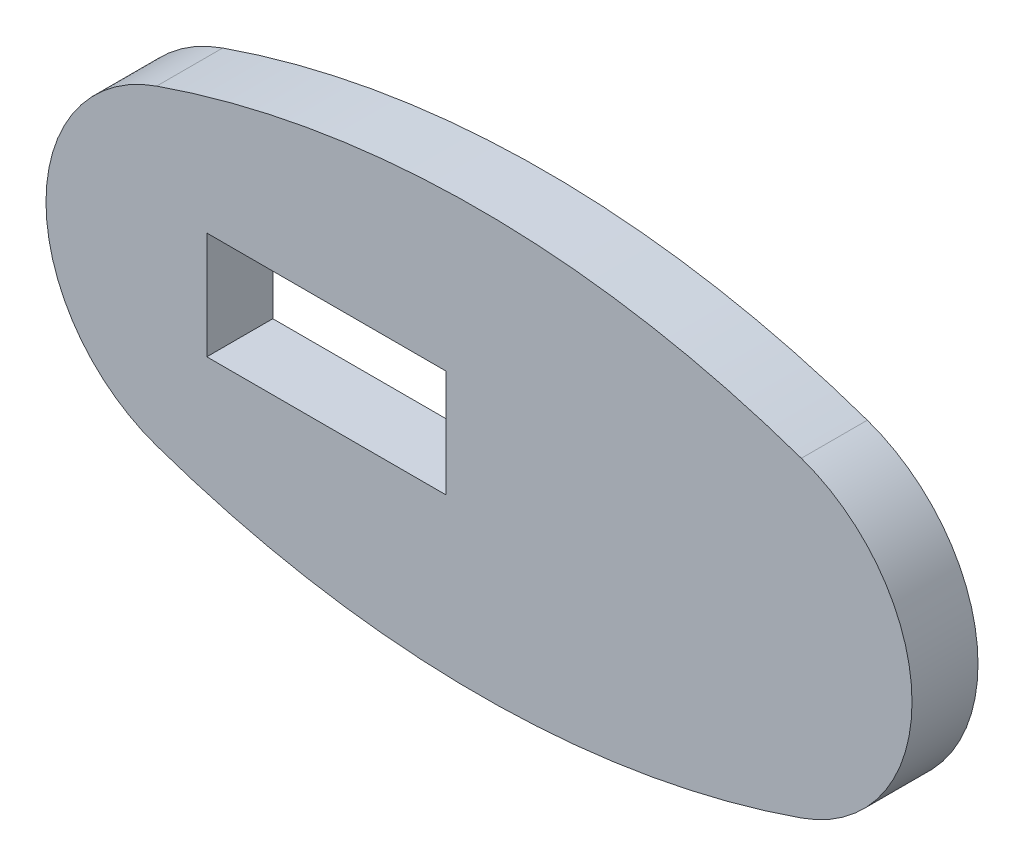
ISO-10303-21;
HEADER;
FILE_DESCRIPTION(('STEP AP214'),'2;1');
FILE_NAME('part.step','',(''),(''),'','','');
FILE_SCHEMA(('AUTOMOTIVE_DESIGN { 1 0 10303 214 1 1 1 1 }'));
ENDSEC;
DATA;
#1=APPLICATION_CONTEXT('core data for automotive mechanical design processes');
#2=APPLICATION_PROTOCOL_DEFINITION('international standard','automotive_design',2000,#1);
#3=PRODUCT_CONTEXT('',#1,'mechanical');
#4=PRODUCT('Part','Part','',(#3));
#5=PRODUCT_RELATED_PRODUCT_CATEGORY('part','',(#4));
#6=PRODUCT_DEFINITION_FORMATION('','',#4);
#7=PRODUCT_DEFINITION_CONTEXT('part definition',#1,'design');
#8=PRODUCT_DEFINITION('design','',#6,#7);
#9=PRODUCT_DEFINITION_SHAPE('','',#8);
#10=(LENGTH_UNIT() NAMED_UNIT(*) SI_UNIT(.MILLI.,.METRE.));
#11=(NAMED_UNIT(*) PLANE_ANGLE_UNIT() SI_UNIT($,.RADIAN.));
#12=(NAMED_UNIT(*) SI_UNIT($,.STERADIAN.) SOLID_ANGLE_UNIT());
#13=UNCERTAINTY_MEASURE_WITH_UNIT(LENGTH_MEASURE(1.E-05),#10,'distance_accuracy_value','');
#14=(GEOMETRIC_REPRESENTATION_CONTEXT(3) GLOBAL_UNCERTAINTY_ASSIGNED_CONTEXT((#13)) GLOBAL_UNIT_ASSIGNED_CONTEXT((#10,
#11,#12)) REPRESENTATION_CONTEXT('',''));
#15=CARTESIAN_POINT('',(0.,0.,0.));
#16=DIRECTION('',(0.,0.,1.));
#17=DIRECTION('',(1.,0.,0.));
#18=AXIS2_PLACEMENT_3D('',#15,#16,#17);
#19=CARTESIAN_POINT('',(16.25,0.,4.));
#20=DIRECTION('',(0.,0.,-1.));
#21=DIRECTION('',(-1.,0.,0.));
#22=AXIS2_PLACEMENT_3D('',#19,#20,#21);
#23=CYLINDRICAL_SURFACE('',#22,9.99999999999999);
#24=CARTESIAN_POINT('',(16.25,0.,0.));
#25=DIRECTION('',(0.,0.,1.));
#26=DIRECTION('',(1.,0.,0.));
#27=AXIS2_PLACEMENT_3D('',#24,#25,#26);
#28=CIRCLE('',#27,9.99999999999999);
#29=CARTESIAN_POINT('',(19.5403819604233,-9.44316612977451,0.));
#30=VERTEX_POINT('',#29);
#31=CARTESIAN_POINT('',(19.5403819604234,9.44316612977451,0.));
#32=VERTEX_POINT('',#31);
#33=EDGE_CURVE('E132',#30,#32,#28,.T.);
#34=ORIENTED_EDGE('',*,*,#33,.T.);
#35=DIRECTION('',(0.,0.,-1.));
#36=VECTOR('',#35,1.);
#37=CARTESIAN_POINT('',(19.5403819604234,9.44316612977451,4.));
#38=LINE('',#37,#36);
#39=CARTESIAN_POINT('',(19.5403819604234,9.44316612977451,4.));
#40=VERTEX_POINT('',#39);
#41=EDGE_CURVE('E13',#40,#32,#38,.T.);
#42=ORIENTED_EDGE('',*,*,#41,.F.);
#43=CARTESIAN_POINT('',(16.25,0.,4.));
#44=DIRECTION('',(0.,0.,1.));
#45=DIRECTION('',(1.,0.,0.));
#46=AXIS2_PLACEMENT_3D('',#43,#44,#45);
#47=CIRCLE('',#46,9.99999999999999);
#48=CARTESIAN_POINT('',(19.5403819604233,-9.44316612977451,4.));
#49=VERTEX_POINT('',#48);
#50=EDGE_CURVE('E143',#49,#40,#47,.T.);
#51=ORIENTED_EDGE('',*,*,#50,.F.);
#52=DIRECTION('',(0.,0.,-1.));
#53=VECTOR('',#52,1.);
#54=CARTESIAN_POINT('',(19.5403819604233,-9.44316612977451,4.));
#55=LINE('',#54,#53);
#56=EDGE_CURVE('E152',#49,#30,#55,.T.);
#57=ORIENTED_EDGE('',*,*,#56,.T.);
#58=EDGE_LOOP('',(#34,#42,#51,#57));
#59=FACE_BOUND('',#58,.T.);
#60=ADVANCED_FACE('F34',(#59),#23,.T.);
#61=CARTESIAN_POINT('',(0.,-46.6363636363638,4.));
#62=DIRECTION('',(0.,0.,-1.));
#63=DIRECTION('',(-1.,0.,0.));
#64=AXIS2_PLACEMENT_3D('',#61,#62,#63);
#65=CYLINDRICAL_SURFACE('',#64,59.3863636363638);
#66=CARTESIAN_POINT('',(0.,-46.6363636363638,0.));
#67=DIRECTION('',(0.,0.,1.));
#68=DIRECTION('',(-1.,0.,0.));
#69=AXIS2_PLACEMENT_3D('',#66,#67,#68);
#70=CIRCLE('',#69,59.3863636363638);
#71=CARTESIAN_POINT('',(-19.5403819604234,9.44316612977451,0.));
#72=VERTEX_POINT('',#71);
#73=EDGE_CURVE('E137',#32,#72,#70,.T.);
#74=ORIENTED_EDGE('',*,*,#73,.T.);
#75=DIRECTION('',(0.,0.,-1.));
#76=VECTOR('',#75,1.);
#77=CARTESIAN_POINT('',(-19.5403819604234,9.44316612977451,4.));
#78=LINE('',#77,#76);
#79=CARTESIAN_POINT('',(-19.5403819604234,9.44316612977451,4.));
#80=VERTEX_POINT('',#79);
#81=EDGE_CURVE('E41',#80,#72,#78,.T.);
#82=ORIENTED_EDGE('',*,*,#81,.F.);
#83=CARTESIAN_POINT('',(0.,-46.6363636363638,4.));
#84=DIRECTION('',(0.,0.,1.));
#85=DIRECTION('',(-1.,0.,0.));
#86=AXIS2_PLACEMENT_3D('',#83,#84,#85);
#87=CIRCLE('',#86,59.3863636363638);
#88=EDGE_CURVE('E146',#40,#80,#87,.T.);
#89=ORIENTED_EDGE('',*,*,#88,.F.);
#90=ORIENTED_EDGE('',*,*,#41,.T.);
#91=EDGE_LOOP('',(#74,#82,#89,#90));
#92=FACE_BOUND('',#91,.T.);
#93=ADVANCED_FACE('F176',(#92),#65,.T.);
#94=CARTESIAN_POINT('',(-16.25,0.,4.));
#95=DIRECTION('',(0.,0.,-1.));
#96=DIRECTION('',(-1.,0.,0.));
#97=AXIS2_PLACEMENT_3D('',#94,#95,#96);
#98=CYLINDRICAL_SURFACE('',#97,10.);
#99=CARTESIAN_POINT('',(-16.25,0.,0.));
#100=DIRECTION('',(0.,0.,1.));
#101=DIRECTION('',(-1.,0.,0.));
#102=AXIS2_PLACEMENT_3D('',#99,#100,#101);
#103=CIRCLE('',#102,10.);
#104=CARTESIAN_POINT('',(-19.5403819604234,-9.44316612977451,0.));
#105=VERTEX_POINT('',#104);
#106=EDGE_CURVE('E139',#72,#105,#103,.T.);
#107=ORIENTED_EDGE('',*,*,#106,.T.);
#108=DIRECTION('',(0.,0.,-1.));
#109=VECTOR('',#108,1.);
#110=CARTESIAN_POINT('',(-19.5403819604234,-9.44316612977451,4.));
#111=LINE('',#110,#109);
#112=CARTESIAN_POINT('',(-19.5403819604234,-9.44316612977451,4.));
#113=VERTEX_POINT('',#112);
#114=EDGE_CURVE('E155',#113,#105,#111,.T.);
#115=ORIENTED_EDGE('',*,*,#114,.F.);
#116=CARTESIAN_POINT('',(-16.25,0.,4.));
#117=DIRECTION('',(0.,0.,1.));
#118=DIRECTION('',(-1.,0.,0.));
#119=AXIS2_PLACEMENT_3D('',#116,#117,#118);
#120=CIRCLE('',#119,10.);
#121=EDGE_CURVE('E148',#80,#113,#120,.T.);
#122=ORIENTED_EDGE('',*,*,#121,.F.);
#123=ORIENTED_EDGE('',*,*,#81,.T.);
#124=EDGE_LOOP('',(#107,#115,#122,#123));
#125=FACE_BOUND('',#124,.T.);
#126=ADVANCED_FACE('F162',(#125),#98,.T.);
#127=CARTESIAN_POINT('',(0.,46.6363636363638,4.));
#128=DIRECTION('',(0.,0.,-1.));
#129=DIRECTION('',(-1.,0.,0.));
#130=AXIS2_PLACEMENT_3D('',#127,#128,#129);
#131=CYLINDRICAL_SURFACE('',#130,59.3863636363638);
#132=CARTESIAN_POINT('',(0.,46.6363636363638,0.));
#133=DIRECTION('',(0.,0.,1.));
#134=DIRECTION('',(1.,0.,0.));
#135=AXIS2_PLACEMENT_3D('',#132,#133,#134);
#136=CIRCLE('',#135,59.3863636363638);
#137=EDGE_CURVE('E141',#105,#30,#136,.T.);
#138=ORIENTED_EDGE('',*,*,#137,.T.);
#139=ORIENTED_EDGE('',*,*,#56,.F.);
#140=CARTESIAN_POINT('',(0.,46.6363636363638,4.));
#141=DIRECTION('',(0.,0.,1.));
#142=DIRECTION('',(1.,0.,0.));
#143=AXIS2_PLACEMENT_3D('',#140,#141,#142);
#144=CIRCLE('',#143,59.3863636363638);
#145=EDGE_CURVE('E150',#113,#49,#144,.T.);
#146=ORIENTED_EDGE('',*,*,#145,.F.);
#147=ORIENTED_EDGE('',*,*,#114,.T.);
#148=EDGE_LOOP('',(#138,#139,#146,#147));
#149=FACE_BOUND('',#148,.T.);
#150=ADVANCED_FACE('F171',(#149),#131,.T.);
#151=CARTESIAN_POINT('',(8.12500000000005,-23.3181818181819,4.));
#152=DIRECTION('',(0.,0.,1.));
#153=DIRECTION('',(1.,0.,0.));
#154=AXIS2_PLACEMENT_3D('',#151,#152,#153);
#155=PLANE('',#154);
#156=DIRECTION('',(0.,-1.,0.));
#157=VECTOR('',#156,1.);
#158=CARTESIAN_POINT('',(-16.5,3.25,4.));
#159=LINE('',#158,#157);
#160=CARTESIAN_POINT('',(-16.5,3.25,4.));
#161=VERTEX_POINT('',#160);
#162=CARTESIAN_POINT('',(-16.5,-3.25,4.));
#163=VERTEX_POINT('',#162);
#164=EDGE_CURVE('E48',#161,#163,#159,.T.);
#165=ORIENTED_EDGE('',*,*,#164,.F.);
#166=DIRECTION('',(-1.,0.,0.));
#167=VECTOR('',#166,1.);
#168=CARTESIAN_POINT('',(-16.5,3.25,4.));
#169=LINE('',#168,#167);
#170=CARTESIAN_POINT('',(-2.,3.25,4.));
#171=VERTEX_POINT('',#170);
#172=EDGE_CURVE('E116',#171,#161,#169,.T.);
#173=ORIENTED_EDGE('',*,*,#172,.F.);
#174=DIRECTION('',(0.,1.,0.));
#175=VECTOR('',#174,1.);
#176=CARTESIAN_POINT('',(-2.,3.25,4.));
#177=LINE('',#176,#175);
#178=CARTESIAN_POINT('',(-2.,-3.25,4.));
#179=VERTEX_POINT('',#178);
#180=EDGE_CURVE('E100',#179,#171,#177,.T.);
#181=ORIENTED_EDGE('',*,*,#180,.F.);
#182=DIRECTION('',(1.,0.,0.));
#183=VECTOR('',#182,1.);
#184=CARTESIAN_POINT('',(-16.5,-3.25,4.));
#185=LINE('',#184,#183);
#186=EDGE_CURVE('E109',#163,#179,#185,.T.);
#187=ORIENTED_EDGE('',*,*,#186,.F.);
#188=EDGE_LOOP('',(#165,#173,#181,#187));
#189=FACE_BOUND('',#188,.T.);
#190=ORIENTED_EDGE('',*,*,#50,.T.);
#191=ORIENTED_EDGE('',*,*,#88,.T.);
#192=ORIENTED_EDGE('',*,*,#121,.T.);
#193=ORIENTED_EDGE('',*,*,#145,.T.);
#194=EDGE_LOOP('',(#190,#191,#192,#193));
#195=FACE_BOUND('',#194,.T.);
#196=ADVANCED_FACE('F113',(#189,#195),#155,.T.);
#197=CARTESIAN_POINT('',(8.12500000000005,-23.3181818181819,0.));
#198=DIRECTION('',(0.,0.,1.));
#199=DIRECTION('',(1.,0.,0.));
#200=AXIS2_PLACEMENT_3D('',#197,#198,#199);
#201=PLANE('',#200);
#202=DIRECTION('',(-1.,0.,0.));
#203=VECTOR('',#202,1.);
#204=CARTESIAN_POINT('',(-16.5,3.25,0.));
#205=LINE('',#204,#203);
#206=CARTESIAN_POINT('',(-2.,3.25,0.));
#207=VERTEX_POINT('',#206);
#208=CARTESIAN_POINT('',(-16.5,3.25,0.));
#209=VERTEX_POINT('',#208);
#210=EDGE_CURVE('E127',#207,#209,#205,.T.);
#211=ORIENTED_EDGE('',*,*,#210,.T.);
#212=DIRECTION('',(0.,-1.,0.));
#213=VECTOR('',#212,1.);
#214=CARTESIAN_POINT('',(-16.5,3.25,0.));
#215=LINE('',#214,#213);
#216=CARTESIAN_POINT('',(-16.5,-3.25,0.));
#217=VERTEX_POINT('',#216);
#218=EDGE_CURVE('E118',#209,#217,#215,.T.);
#219=ORIENTED_EDGE('',*,*,#218,.T.);
#220=DIRECTION('',(1.,0.,0.));
#221=VECTOR('',#220,1.);
#222=CARTESIAN_POINT('',(-16.5,-3.25,0.));
#223=LINE('',#222,#221);
#224=CARTESIAN_POINT('',(-2.,-3.25,0.));
#225=VERTEX_POINT('',#224);
#226=EDGE_CURVE('E124',#217,#225,#223,.T.);
#227=ORIENTED_EDGE('',*,*,#226,.T.);
#228=DIRECTION('',(0.,1.,0.));
#229=VECTOR('',#228,1.);
#230=CARTESIAN_POINT('',(-2.,3.25,0.));
#231=LINE('',#230,#229);
#232=EDGE_CURVE('E56',#225,#207,#231,.T.);
#233=ORIENTED_EDGE('',*,*,#232,.T.);
#234=EDGE_LOOP('',(#211,#219,#227,#233));
#235=FACE_BOUND('',#234,.T.);
#236=ORIENTED_EDGE('',*,*,#33,.F.);
#237=ORIENTED_EDGE('',*,*,#137,.F.);
#238=ORIENTED_EDGE('',*,*,#106,.F.);
#239=ORIENTED_EDGE('',*,*,#73,.F.);
#240=EDGE_LOOP('',(#236,#237,#238,#239));
#241=FACE_BOUND('',#240,.T.);
#242=ADVANCED_FACE('F168',(#235,#241),#201,.F.);
#243=CARTESIAN_POINT('',(-16.5,3.25,0.));
#244=DIRECTION('',(-1.,0.,0.));
#245=DIRECTION('',(0.,0.,1.));
#246=AXIS2_PLACEMENT_3D('',#243,#244,#245);
#247=PLANE('',#246);
#248=ORIENTED_EDGE('',*,*,#164,.T.);
#249=DIRECTION('',(0.,0.,1.));
#250=VECTOR('',#249,1.);
#251=CARTESIAN_POINT('',(-16.5,-3.25,0.));
#252=LINE('',#251,#250);
#253=EDGE_CURVE('E106',#217,#163,#252,.T.);
#254=ORIENTED_EDGE('',*,*,#253,.F.);
#255=ORIENTED_EDGE('',*,*,#218,.F.);
#256=DIRECTION('',(0.,0.,1.));
#257=VECTOR('',#256,1.);
#258=CARTESIAN_POINT('',(-16.5,3.25,0.));
#259=LINE('',#258,#257);
#260=EDGE_CURVE('E130',#209,#161,#259,.T.);
#261=ORIENTED_EDGE('',*,*,#260,.T.);
#262=EDGE_LOOP('',(#248,#254,#255,#261));
#263=FACE_BOUND('',#262,.T.);
#264=ADVANCED_FACE('F190',(#263),#247,.F.);
#265=CARTESIAN_POINT('',(-16.5,3.25,0.));
#266=DIRECTION('',(0.,1.,0.));
#267=DIRECTION('',(-1.,0.,0.));
#268=AXIS2_PLACEMENT_3D('',#265,#266,#267);
#269=PLANE('',#268);
#270=ORIENTED_EDGE('',*,*,#172,.T.);
#271=ORIENTED_EDGE('',*,*,#260,.F.);
#272=ORIENTED_EDGE('',*,*,#210,.F.);
#273=DIRECTION('',(0.,0.,1.));
#274=VECTOR('',#273,1.);
#275=CARTESIAN_POINT('',(-2.,3.25,0.));
#276=LINE('',#275,#274);
#277=EDGE_CURVE('E105',#207,#171,#276,.T.);
#278=ORIENTED_EDGE('',*,*,#277,.T.);
#279=EDGE_LOOP('',(#270,#271,#272,#278));
#280=FACE_BOUND('',#279,.T.);
#281=ADVANCED_FACE('F194',(#280),#269,.F.);
#282=CARTESIAN_POINT('',(-2.,3.25,0.));
#283=DIRECTION('',(1.,0.,0.));
#284=DIRECTION('',(0.,1.,0.));
#285=AXIS2_PLACEMENT_3D('',#282,#283,#284);
#286=PLANE('',#285);
#287=ORIENTED_EDGE('',*,*,#180,.T.);
#288=ORIENTED_EDGE('',*,*,#277,.F.);
#289=ORIENTED_EDGE('',*,*,#232,.F.);
#290=DIRECTION('',(0.,0.,1.));
#291=VECTOR('',#290,1.);
#292=CARTESIAN_POINT('',(-2.,-3.25,0.));
#293=LINE('',#292,#291);
#294=EDGE_CURVE('E96',#225,#179,#293,.T.);
#295=ORIENTED_EDGE('',*,*,#294,.T.);
#296=EDGE_LOOP('',(#287,#288,#289,#295));
#297=FACE_BOUND('',#296,.T.);
#298=ADVANCED_FACE('F98',(#297),#286,.F.);
#299=CARTESIAN_POINT('',(-16.5,-3.25,0.));
#300=DIRECTION('',(0.,-1.,0.));
#301=DIRECTION('',(1.,0.,0.));
#302=AXIS2_PLACEMENT_3D('',#299,#300,#301);
#303=PLANE('',#302);
#304=ORIENTED_EDGE('',*,*,#186,.T.);
#305=ORIENTED_EDGE('',*,*,#294,.F.);
#306=ORIENTED_EDGE('',*,*,#226,.F.);
#307=ORIENTED_EDGE('',*,*,#253,.T.);
#308=EDGE_LOOP('',(#304,#305,#306,#307));
#309=FACE_BOUND('',#308,.T.);
#310=ADVANCED_FACE('F110',(#309),#303,.F.);
#311=CLOSED_SHELL('',(#60,#93,#126,#150,#196,#242,#264,#281,#298,#310));
#312=MANIFOLD_SOLID_BREP('B2',#311);
#313=ADVANCED_BREP_SHAPE_REPRESENTATION('',(#18,#312),#14);
#314=SHAPE_DEFINITION_REPRESENTATION(#9,#313);
ENDSEC;
END-ISO-10303-21;
